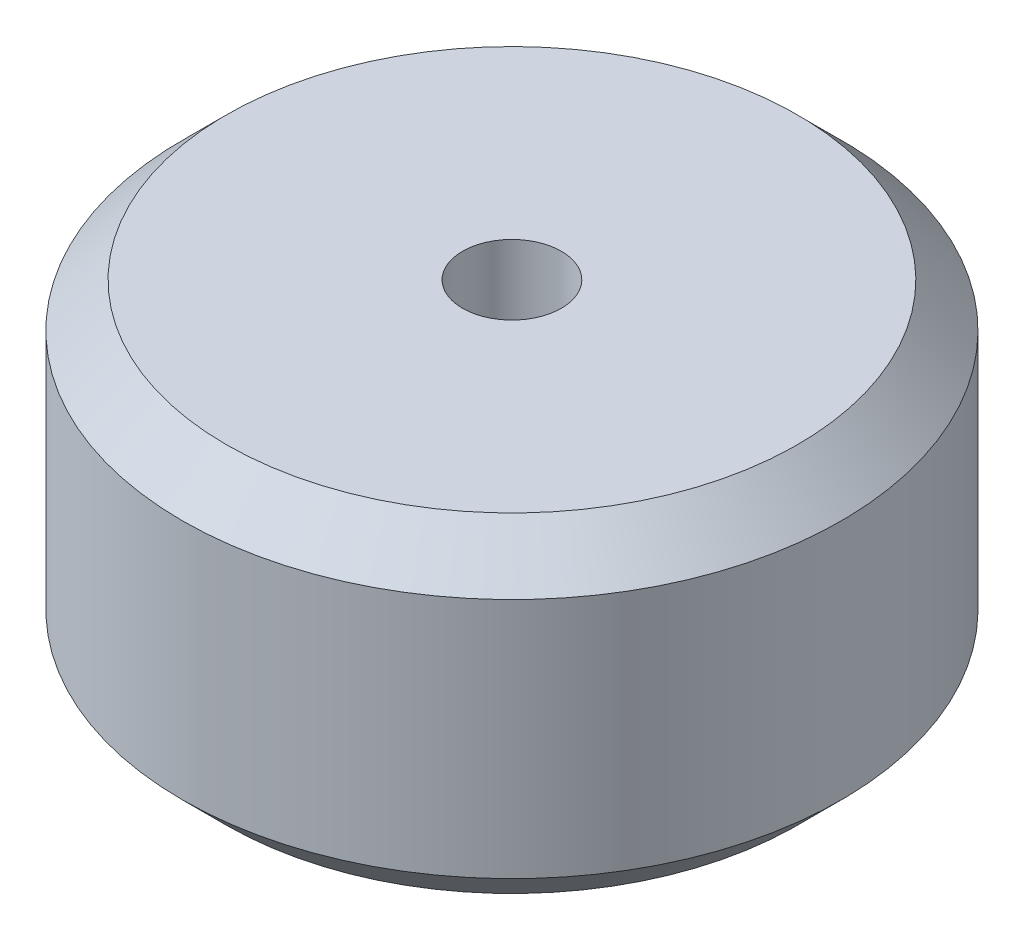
ISO-10303-21;
HEADER;
FILE_DESCRIPTION(('STEP AP214'),'2;1');
FILE_NAME('part.step','',(''),(''),'','','');
FILE_SCHEMA(('AUTOMOTIVE_DESIGN { 1 0 10303 214 1 1 1 1 }'));
ENDSEC;
DATA;
#1=APPLICATION_CONTEXT('core data for automotive mechanical design processes');
#2=APPLICATION_PROTOCOL_DEFINITION('international standard','automotive_design',2000,#1);
#3=PRODUCT_CONTEXT('',#1,'mechanical');
#4=PRODUCT('Part','Part','',(#3));
#5=PRODUCT_RELATED_PRODUCT_CATEGORY('part','',(#4));
#6=PRODUCT_DEFINITION_FORMATION('','',#4);
#7=PRODUCT_DEFINITION_CONTEXT('part definition',#1,'design');
#8=PRODUCT_DEFINITION('design','',#6,#7);
#9=PRODUCT_DEFINITION_SHAPE('','',#8);
#10=(LENGTH_UNIT() NAMED_UNIT(*) SI_UNIT(.MILLI.,.METRE.));
#11=(NAMED_UNIT(*) PLANE_ANGLE_UNIT() SI_UNIT($,.RADIAN.));
#12=(NAMED_UNIT(*) SI_UNIT($,.STERADIAN.) SOLID_ANGLE_UNIT());
#13=UNCERTAINTY_MEASURE_WITH_UNIT(LENGTH_MEASURE(1.E-05),#10,'distance_accuracy_value','');
#14=(GEOMETRIC_REPRESENTATION_CONTEXT(3) GLOBAL_UNCERTAINTY_ASSIGNED_CONTEXT((#13)) GLOBAL_UNIT_ASSIGNED_CONTEXT((#10,
#11,#12)) REPRESENTATION_CONTEXT('',''));
#15=CARTESIAN_POINT('',(0.,0.,0.));
#16=DIRECTION('',(0.,0.,1.));
#17=DIRECTION('',(1.,0.,0.));
#18=AXIS2_PLACEMENT_3D('',#15,#16,#17);
#19=CARTESIAN_POINT('',(0.,15.,0.));
#20=DIRECTION('',(0.,-1.,0.));
#21=DIRECTION('',(0.,0.,-1.));
#22=AXIS2_PLACEMENT_3D('',#19,#20,#21);
#23=CYLINDRICAL_SURFACE('',#22,15.);
#24=CARTESIAN_POINT('',(0.,2.,0.));
#25=DIRECTION('',(0.,1.,0.));
#26=DIRECTION('',(0.,0.,1.));
#27=AXIS2_PLACEMENT_3D('',#24,#25,#26);
#28=CIRCLE('',#27,15.);
#29=CARTESIAN_POINT('',(0.,2.,15.));
#30=VERTEX_POINT('',#29);
#31=EDGE_CURVE('E42',#30,#30,#28,.T.);
#32=ORIENTED_EDGE('',*,*,#31,.T.);
#33=EDGE_LOOP('',(#32));
#34=FACE_BOUND('',#33,.T.);
#35=CARTESIAN_POINT('',(0.,13.,0.));
#36=DIRECTION('',(0.,1.,0.));
#37=DIRECTION('',(0.,0.,1.));
#38=AXIS2_PLACEMENT_3D('',#35,#36,#37);
#39=CIRCLE('',#38,15.);
#40=CARTESIAN_POINT('',(0.,13.,15.));
#41=VERTEX_POINT('',#40);
#42=EDGE_CURVE('E46',#41,#41,#39,.F.);
#43=ORIENTED_EDGE('',*,*,#42,.T.);
#44=EDGE_LOOP('',(#43));
#45=FACE_BOUND('',#44,.T.);
#46=ADVANCED_FACE('F31',(#34,#45),#23,.T.);
#47=CARTESIAN_POINT('',(0.,15.,0.));
#48=DIRECTION('',(0.,1.,0.));
#49=DIRECTION('',(0.,0.,1.));
#50=AXIS2_PLACEMENT_3D('',#47,#48,#49);
#51=PLANE('',#50);
#52=CARTESIAN_POINT('',(0.,15.,0.));
#53=DIRECTION('',(0.,1.,0.));
#54=DIRECTION('',(0.,0.,1.));
#55=AXIS2_PLACEMENT_3D('',#52,#53,#54);
#56=CIRCLE('',#55,2.25);
#57=CARTESIAN_POINT('',(0.,15.,2.25));
#58=VERTEX_POINT('',#57);
#59=EDGE_CURVE('E52',#58,#58,#56,.T.);
#60=ORIENTED_EDGE('',*,*,#59,.F.);
#61=EDGE_LOOP('',(#60));
#62=FACE_BOUND('',#61,.T.);
#63=CARTESIAN_POINT('',(0.,15.,0.));
#64=DIRECTION('',(0.,1.,0.));
#65=DIRECTION('',(0.,0.,1.));
#66=AXIS2_PLACEMENT_3D('',#63,#64,#65);
#67=CIRCLE('',#66,13.);
#68=CARTESIAN_POINT('',(0.,15.,13.));
#69=VERTEX_POINT('',#68);
#70=EDGE_CURVE('E10',#69,#69,#67,.T.);
#71=ORIENTED_EDGE('',*,*,#70,.T.);
#72=EDGE_LOOP('',(#71));
#73=FACE_BOUND('',#72,.T.);
#74=ADVANCED_FACE('F66',(#62,#73),#51,.T.);
#75=CARTESIAN_POINT('',(0.,0.,0.));
#76=DIRECTION('',(0.,1.,0.));
#77=DIRECTION('',(0.,0.,1.));
#78=AXIS2_PLACEMENT_3D('',#75,#76,#77);
#79=PLANE('',#78);
#80=CARTESIAN_POINT('',(0.,0.,0.));
#81=DIRECTION('',(0.,1.,0.));
#82=DIRECTION('',(0.,0.,1.));
#83=AXIS2_PLACEMENT_3D('',#80,#81,#82);
#84=CIRCLE('',#83,13.);
#85=CARTESIAN_POINT('',(0.,0.,13.));
#86=VERTEX_POINT('',#85);
#87=EDGE_CURVE('E38',#86,#86,#84,.F.);
#88=ORIENTED_EDGE('',*,*,#87,.T.);
#89=EDGE_LOOP('',(#88));
#90=FACE_BOUND('',#89,.T.);
#91=ADVANCED_FACE('F68',(#90),#79,.F.);
#92=CARTESIAN_POINT('',(0.,2.,0.));
#93=DIRECTION('',(0.,1.,0.));
#94=DIRECTION('',(0.,0.,1.));
#95=AXIS2_PLACEMENT_3D('',#92,#93,#94);
#96=CONICAL_SURFACE('',#95,15.,0.78539816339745);
#97=ORIENTED_EDGE('',*,*,#87,.F.);
#98=EDGE_LOOP('',(#97));
#99=FACE_BOUND('',#98,.T.);
#100=ORIENTED_EDGE('',*,*,#31,.F.);
#101=EDGE_LOOP('',(#100));
#102=FACE_BOUND('',#101,.T.);
#103=ADVANCED_FACE('F74',(#99,#102),#96,.T.);
#104=CARTESIAN_POINT('',(0.,15.,0.));
#105=DIRECTION('',(0.,-1.,0.));
#106=DIRECTION('',(0.,0.,-1.));
#107=AXIS2_PLACEMENT_3D('',#104,#105,#106);
#108=CONICAL_SURFACE('',#107,13.,0.785398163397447);
#109=ORIENTED_EDGE('',*,*,#42,.F.);
#110=EDGE_LOOP('',(#109));
#111=FACE_BOUND('',#110,.T.);
#112=ORIENTED_EDGE('',*,*,#70,.F.);
#113=EDGE_LOOP('',(#112));
#114=FACE_BOUND('',#113,.T.);
#115=ADVANCED_FACE('F33',(#111,#114),#108,.T.);
#116=CARTESIAN_POINT('',(0.,7.5,0.));
#117=DIRECTION('',(0.,1.,0.));
#118=DIRECTION('',(0.,0.,1.));
#119=AXIS2_PLACEMENT_3D('',#116,#117,#118);
#120=CYLINDRICAL_SURFACE('',#119,2.25);
#121=CARTESIAN_POINT('',(0.,7.5,0.));
#122=DIRECTION('',(0.,1.,0.));
#123=DIRECTION('',(0.,0.,1.));
#124=AXIS2_PLACEMENT_3D('',#121,#122,#123);
#125=CIRCLE('',#124,2.25);
#126=CARTESIAN_POINT('',(0.,7.5,2.25));
#127=VERTEX_POINT('',#126);
#128=EDGE_CURVE('E51',#127,#127,#125,.T.);
#129=ORIENTED_EDGE('',*,*,#128,.F.);
#130=EDGE_LOOP('',(#129));
#131=FACE_BOUND('',#130,.T.);
#132=ORIENTED_EDGE('',*,*,#59,.T.);
#133=EDGE_LOOP('',(#132));
#134=FACE_BOUND('',#133,.T.);
#135=ADVANCED_FACE('F60',(#131,#134),#120,.F.);
#136=CARTESIAN_POINT('',(0.,7.5,0.));
#137=DIRECTION('',(0.,1.,0.));
#138=DIRECTION('',(0.,0.,1.));
#139=AXIS2_PLACEMENT_3D('',#136,#137,#138);
#140=PLANE('',#139);
#141=ORIENTED_EDGE('',*,*,#128,.T.);
#142=EDGE_LOOP('',(#141));
#143=FACE_BOUND('',#142,.T.);
#144=ADVANCED_FACE('F58',(#143),#140,.T.);
#145=CLOSED_SHELL('',(#46,#74,#91,#103,#115,#135,#144));
#146=MANIFOLD_SOLID_BREP('B2',#145);
#147=ADVANCED_BREP_SHAPE_REPRESENTATION('',(#18,#146),#14);
#148=SHAPE_DEFINITION_REPRESENTATION(#9,#147);
ENDSEC;
END-ISO-10303-21;
